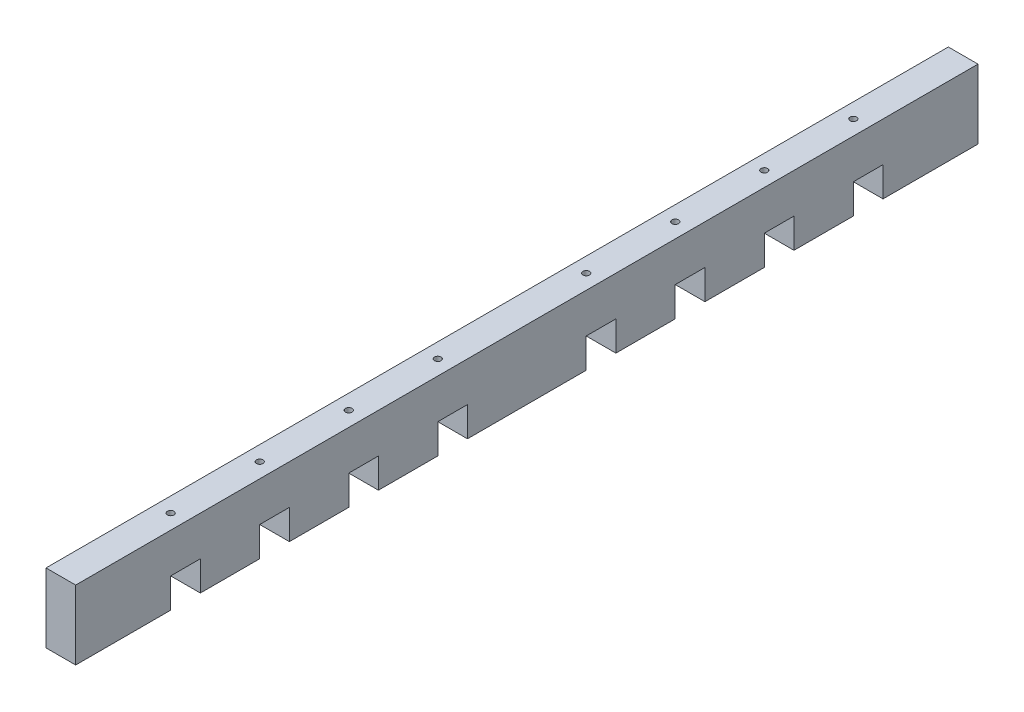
ISO-10303-21;
HEADER;
FILE_DESCRIPTION(('STEP AP214'),'2;1');
FILE_NAME('part.step','',(''),(''),'','','');
FILE_SCHEMA(('AUTOMOTIVE_DESIGN { 1 0 10303 214 1 1 1 1 }'));
ENDSEC;
DATA;
#1=APPLICATION_CONTEXT('core data for automotive mechanical design processes');
#2=APPLICATION_PROTOCOL_DEFINITION('international standard','automotive_design',2000,#1);
#3=PRODUCT_CONTEXT('',#1,'mechanical');
#4=PRODUCT('Part','Part','',(#3));
#5=PRODUCT_RELATED_PRODUCT_CATEGORY('part','',(#4));
#6=PRODUCT_DEFINITION_FORMATION('','',#4);
#7=PRODUCT_DEFINITION_CONTEXT('part definition',#1,'design');
#8=PRODUCT_DEFINITION('design','',#6,#7);
#9=PRODUCT_DEFINITION_SHAPE('','',#8);
#10=(LENGTH_UNIT() NAMED_UNIT(*) SI_UNIT(.MILLI.,.METRE.));
#11=(NAMED_UNIT(*) PLANE_ANGLE_UNIT() SI_UNIT($,.RADIAN.));
#12=(NAMED_UNIT(*) SI_UNIT($,.STERADIAN.) SOLID_ANGLE_UNIT());
#13=UNCERTAINTY_MEASURE_WITH_UNIT(LENGTH_MEASURE(1.E-05),#10,'distance_accuracy_value','');
#14=(GEOMETRIC_REPRESENTATION_CONTEXT(3) GLOBAL_UNCERTAINTY_ASSIGNED_CONTEXT((#13)) GLOBAL_UNIT_ASSIGNED_CONTEXT((#10,
#11,#12)) REPRESENTATION_CONTEXT('',''));
#15=CARTESIAN_POINT('',(0.,0.,0.));
#16=DIRECTION('',(0.,0.,1.));
#17=DIRECTION('',(1.,0.,0.));
#18=AXIS2_PLACEMENT_3D('',#15,#16,#17);
#19=CARTESIAN_POINT('',(0.,0.,228.));
#20=DIRECTION('',(0.,1.,0.));
#21=DIRECTION('',(-1.,0.,0.));
#22=AXIS2_PLACEMENT_3D('',#19,#20,#21);
#23=PLANE('',#22);
#24=DIRECTION('',(1.,0.,0.));
#25=VECTOR('',#24,1.);
#26=CARTESIAN_POINT('',(-15.,0.,-165.));
#27=LINE('',#26,#25);
#28=CARTESIAN_POINT('',(-15.,0.,-165.));
#29=VERTEX_POINT('',#28);
#30=CARTESIAN_POINT('',(0.,0.,-165.));
#31=VERTEX_POINT('',#30);
#32=EDGE_CURVE('E265',#29,#31,#27,.T.);
#33=ORIENTED_EDGE('',*,*,#32,.T.);
#34=DIRECTION('',(0.,0.,-1.));
#35=VECTOR('',#34,1.);
#36=CARTESIAN_POINT('',(0.,0.,228.));
#37=LINE('',#36,#35);
#38=CARTESIAN_POINT('',(0.,0.,-135.));
#39=VERTEX_POINT('',#38);
#40=EDGE_CURVE('E587',#39,#31,#37,.T.);
#41=ORIENTED_EDGE('',*,*,#40,.F.);
#42=DIRECTION('',(1.,0.,0.));
#43=VECTOR('',#42,1.);
#44=CARTESIAN_POINT('',(-15.,0.,-135.));
#45=LINE('',#44,#43);
#46=CARTESIAN_POINT('',(-15.,0.,-135.));
#47=VERTEX_POINT('',#46);
#48=EDGE_CURVE('E291',#47,#39,#45,.T.);
#49=ORIENTED_EDGE('',*,*,#48,.F.);
#50=DIRECTION('',(0.,0.,-1.));
#51=VECTOR('',#50,1.);
#52=CARTESIAN_POINT('',(-15.,0.,228.));
#53=LINE('',#52,#51);
#54=EDGE_CURVE('E285',#47,#29,#53,.T.);
#55=ORIENTED_EDGE('',*,*,#54,.T.);
#56=EDGE_LOOP('',(#33,#41,#49,#55));
#57=FACE_BOUND('',#56,.T.);
#58=ADVANCED_FACE('F33',(#57),#23,.F.);
#59=DIRECTION('',(1.,0.,0.));
#60=VECTOR('',#59,1.);
#61=CARTESIAN_POINT('',(-15.,0.,-180.));
#62=LINE('',#61,#60);
#63=CARTESIAN_POINT('',(-15.,0.,-180.));
#64=VERTEX_POINT('',#63);
#65=CARTESIAN_POINT('',(0.,0.,-180.));
#66=VERTEX_POINT('',#65);
#67=EDGE_CURVE('E277',#64,#66,#62,.T.);
#68=ORIENTED_EDGE('',*,*,#67,.F.);
#69=CARTESIAN_POINT('',(-15.,0.,-228.));
#70=VERTEX_POINT('',#69);
#71=EDGE_CURVE('E293',#64,#70,#53,.T.);
#72=ORIENTED_EDGE('',*,*,#71,.T.);
#73=DIRECTION('',(1.,0.,0.));
#74=VECTOR('',#73,1.);
#75=CARTESIAN_POINT('',(0.,0.,-228.));
#76=LINE('',#75,#74);
#77=CARTESIAN_POINT('',(0.,0.,-228.));
#78=VERTEX_POINT('',#77);
#79=EDGE_CURVE('E320',#70,#78,#76,.T.);
#80=ORIENTED_EDGE('',*,*,#79,.T.);
#81=EDGE_CURVE('E331',#66,#78,#37,.T.);
#82=ORIENTED_EDGE('',*,*,#81,.F.);
#83=EDGE_LOOP('',(#68,#72,#80,#82));
#84=FACE_BOUND('',#83,.T.);
#85=ADVANCED_FACE('F646',(#84),#23,.F.);
#86=CARTESIAN_POINT('',(0.,0.,228.));
#87=DIRECTION('',(-1.,0.,0.));
#88=DIRECTION('',(0.,0.,1.));
#89=AXIS2_PLACEMENT_3D('',#86,#87,#88);
#90=PLANE('',#89);
#91=DIRECTION('',(0.,1.,0.));
#92=VECTOR('',#91,1.);
#93=CARTESIAN_POINT('',(0.,0.,-165.));
#94=LINE('',#93,#92);
#95=CARTESIAN_POINT('',(0.,15.,-165.));
#96=VERTEX_POINT('',#95);
#97=EDGE_CURVE('E272',#31,#96,#94,.T.);
#98=ORIENTED_EDGE('',*,*,#97,.T.);
#99=DIRECTION('',(0.,0.,-1.));
#100=VECTOR('',#99,1.);
#101=CARTESIAN_POINT('',(0.,15.,-165.));
#102=LINE('',#101,#100);
#103=CARTESIAN_POINT('',(0.,15.,-180.));
#104=VERTEX_POINT('',#103);
#105=EDGE_CURVE('E288',#96,#104,#102,.T.);
#106=ORIENTED_EDGE('',*,*,#105,.T.);
#107=DIRECTION('',(0.,-1.,0.));
#108=VECTOR('',#107,1.);
#109=CARTESIAN_POINT('',(0.,0.,-180.));
#110=LINE('',#109,#108);
#111=EDGE_CURVE('E548',#104,#66,#110,.T.);
#112=ORIENTED_EDGE('',*,*,#111,.T.);
#113=ORIENTED_EDGE('',*,*,#81,.T.);
#114=DIRECTION('',(0.,1.,0.));
#115=VECTOR('',#114,1.);
#116=CARTESIAN_POINT('',(0.,0.,-228.));
#117=LINE('',#116,#115);
#118=CARTESIAN_POINT('',(0.,35.,-228.));
#119=VERTEX_POINT('',#118);
#120=EDGE_CURVE('E323',#78,#119,#117,.T.);
#121=ORIENTED_EDGE('',*,*,#120,.T.);
#122=DIRECTION('',(0.,0.,-1.));
#123=VECTOR('',#122,1.);
#124=CARTESIAN_POINT('',(0.,35.,228.));
#125=LINE('',#124,#123);
#126=CARTESIAN_POINT('',(0.,35.,228.));
#127=VERTEX_POINT('',#126);
#128=EDGE_CURVE('E11',#127,#119,#125,.T.);
#129=ORIENTED_EDGE('',*,*,#128,.F.);
#130=DIRECTION('',(0.,1.,0.));
#131=VECTOR('',#130,1.);
#132=CARTESIAN_POINT('',(0.,0.,228.));
#133=LINE('',#132,#131);
#134=CARTESIAN_POINT('',(0.,0.,228.));
#135=VERTEX_POINT('',#134);
#136=EDGE_CURVE('E322',#135,#127,#133,.T.);
#137=ORIENTED_EDGE('',*,*,#136,.F.);
#138=CARTESIAN_POINT('',(0.,0.,180.));
#139=VERTEX_POINT('',#138);
#140=EDGE_CURVE('E297',#135,#139,#37,.T.);
#141=ORIENTED_EDGE('',*,*,#140,.T.);
#142=DIRECTION('',(0.,-1.,0.));
#143=VECTOR('',#142,1.);
#144=CARTESIAN_POINT('',(0.,0.,180.));
#145=LINE('',#144,#143);
#146=CARTESIAN_POINT('',(0.,15.,180.));
#147=VERTEX_POINT('',#146);
#148=EDGE_CURVE('E433',#147,#139,#145,.T.);
#149=ORIENTED_EDGE('',*,*,#148,.F.);
#150=DIRECTION('',(0.,0.,1.));
#151=VECTOR('',#150,1.);
#152=CARTESIAN_POINT('',(0.,15.,165.));
#153=LINE('',#152,#151);
#154=CARTESIAN_POINT('',(0.,15.,165.));
#155=VERTEX_POINT('',#154);
#156=EDGE_CURVE('E436',#155,#147,#153,.T.);
#157=ORIENTED_EDGE('',*,*,#156,.F.);
#158=DIRECTION('',(0.,1.,0.));
#159=VECTOR('',#158,1.);
#160=CARTESIAN_POINT('',(0.,0.,165.));
#161=LINE('',#160,#159);
#162=CARTESIAN_POINT('',(0.,0.,165.));
#163=VERTEX_POINT('',#162);
#164=EDGE_CURVE('E439',#163,#155,#161,.T.);
#165=ORIENTED_EDGE('',*,*,#164,.F.);
#166=CARTESIAN_POINT('',(0.,0.,135.));
#167=VERTEX_POINT('',#166);
#168=EDGE_CURVE('E593',#163,#167,#37,.T.);
#169=ORIENTED_EDGE('',*,*,#168,.T.);
#170=DIRECTION('',(0.,-1.,0.));
#171=VECTOR('',#170,1.);
#172=CARTESIAN_POINT('',(0.,0.,135.));
#173=LINE('',#172,#171);
#174=CARTESIAN_POINT('',(0.,15.,135.));
#175=VERTEX_POINT('',#174);
#176=EDGE_CURVE('E406',#175,#167,#173,.T.);
#177=ORIENTED_EDGE('',*,*,#176,.F.);
#178=DIRECTION('',(0.,0.,1.));
#179=VECTOR('',#178,1.);
#180=CARTESIAN_POINT('',(0.,15.,120.));
#181=LINE('',#180,#179);
#182=CARTESIAN_POINT('',(0.,15.,120.));
#183=VERTEX_POINT('',#182);
#184=EDGE_CURVE('E410',#183,#175,#181,.T.);
#185=ORIENTED_EDGE('',*,*,#184,.F.);
#186=DIRECTION('',(0.,1.,0.));
#187=VECTOR('',#186,1.);
#188=CARTESIAN_POINT('',(0.,0.,120.));
#189=LINE('',#188,#187);
#190=CARTESIAN_POINT('',(0.,0.,120.));
#191=VERTEX_POINT('',#190);
#192=EDGE_CURVE('E413',#191,#183,#189,.T.);
#193=ORIENTED_EDGE('',*,*,#192,.F.);
#194=CARTESIAN_POINT('',(0.,0.,90.0000000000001));
#195=VERTEX_POINT('',#194);
#196=EDGE_CURVE('E598',#191,#195,#37,.T.);
#197=ORIENTED_EDGE('',*,*,#196,.T.);
#198=DIRECTION('',(0.,-1.,0.));
#199=VECTOR('',#198,1.);
#200=CARTESIAN_POINT('',(0.,0.,90.));
#201=LINE('',#200,#199);
#202=CARTESIAN_POINT('',(0.,15.,90.));
#203=VERTEX_POINT('',#202);
#204=EDGE_CURVE('E379',#203,#195,#201,.T.);
#205=ORIENTED_EDGE('',*,*,#204,.F.);
#206=DIRECTION('',(0.,0.,1.));
#207=VECTOR('',#206,1.);
#208=CARTESIAN_POINT('',(0.,15.,75.));
#209=LINE('',#208,#207);
#210=CARTESIAN_POINT('',(0.,15.,75.));
#211=VERTEX_POINT('',#210);
#212=EDGE_CURVE('E383',#211,#203,#209,.T.);
#213=ORIENTED_EDGE('',*,*,#212,.F.);
#214=DIRECTION('',(0.,1.,0.));
#215=VECTOR('',#214,1.);
#216=CARTESIAN_POINT('',(0.,0.,75.));
#217=LINE('',#216,#215);
#218=CARTESIAN_POINT('',(0.,0.,75.));
#219=VERTEX_POINT('',#218);
#220=EDGE_CURVE('E386',#219,#211,#217,.T.);
#221=ORIENTED_EDGE('',*,*,#220,.F.);
#222=CARTESIAN_POINT('',(0.,0.,45.));
#223=VERTEX_POINT('',#222);
#224=EDGE_CURVE('E600',#219,#223,#37,.T.);
#225=ORIENTED_EDGE('',*,*,#224,.T.);
#226=DIRECTION('',(0.,-1.,0.));
#227=VECTOR('',#226,1.);
#228=CARTESIAN_POINT('',(0.,0.,45.));
#229=LINE('',#228,#227);
#230=CARTESIAN_POINT('',(0.,15.,45.));
#231=VERTEX_POINT('',#230);
#232=EDGE_CURVE('E346',#231,#223,#229,.T.);
#233=ORIENTED_EDGE('',*,*,#232,.F.);
#234=DIRECTION('',(0.,0.,1.));
#235=VECTOR('',#234,1.);
#236=CARTESIAN_POINT('',(0.,15.,30.));
#237=LINE('',#236,#235);
#238=CARTESIAN_POINT('',(0.,15.,30.));
#239=VERTEX_POINT('',#238);
#240=EDGE_CURVE('E350',#239,#231,#237,.T.);
#241=ORIENTED_EDGE('',*,*,#240,.F.);
#242=DIRECTION('',(0.,1.,0.));
#243=VECTOR('',#242,1.);
#244=CARTESIAN_POINT('',(0.,0.,30.));
#245=LINE('',#244,#243);
#246=CARTESIAN_POINT('',(0.,0.,30.));
#247=VERTEX_POINT('',#246);
#248=EDGE_CURVE('E353',#247,#239,#245,.T.);
#249=ORIENTED_EDGE('',*,*,#248,.F.);
#250=CARTESIAN_POINT('',(0.,0.,-30.));
#251=VERTEX_POINT('',#250);
#252=EDGE_CURVE('E594',#247,#251,#37,.T.);
#253=ORIENTED_EDGE('',*,*,#252,.T.);
#254=DIRECTION('',(0.,1.,0.));
#255=VECTOR('',#254,1.);
#256=CARTESIAN_POINT('',(0.,0.,-30.));
#257=LINE('',#256,#255);
#258=CARTESIAN_POINT('',(0.,15.,-30.));
#259=VERTEX_POINT('',#258);
#260=EDGE_CURVE('E485',#251,#259,#257,.T.);
#261=ORIENTED_EDGE('',*,*,#260,.T.);
#262=DIRECTION('',(0.,0.,-1.));
#263=VECTOR('',#262,1.);
#264=CARTESIAN_POINT('',(0.,15.,-30.));
#265=LINE('',#264,#263);
#266=CARTESIAN_POINT('',(0.,15.,-45.));
#267=VERTEX_POINT('',#266);
#268=EDGE_CURVE('E478',#259,#267,#265,.T.);
#269=ORIENTED_EDGE('',*,*,#268,.T.);
#270=DIRECTION('',(0.,-1.,0.));
#271=VECTOR('',#270,1.);
#272=CARTESIAN_POINT('',(0.,0.,-45.));
#273=LINE('',#272,#271);
#274=CARTESIAN_POINT('',(0.,0.,-45.));
#275=VERTEX_POINT('',#274);
#276=EDGE_CURVE('E482',#267,#275,#273,.T.);
#277=ORIENTED_EDGE('',*,*,#276,.T.);
#278=CARTESIAN_POINT('',(0.,0.,-75.));
#279=VERTEX_POINT('',#278);
#280=EDGE_CURVE('E590',#275,#279,#37,.T.);
#281=ORIENTED_EDGE('',*,*,#280,.T.);
#282=DIRECTION('',(0.,1.,0.));
#283=VECTOR('',#282,1.);
#284=CARTESIAN_POINT('',(0.,0.,-75.));
#285=LINE('',#284,#283);
#286=CARTESIAN_POINT('',(0.,15.,-75.));
#287=VERTEX_POINT('',#286);
#288=EDGE_CURVE('E511',#279,#287,#285,.T.);
#289=ORIENTED_EDGE('',*,*,#288,.T.);
#290=DIRECTION('',(0.,0.,-1.));
#291=VECTOR('',#290,1.);
#292=CARTESIAN_POINT('',(0.,15.,-75.));
#293=LINE('',#292,#291);
#294=CARTESIAN_POINT('',(0.,15.,-90.));
#295=VERTEX_POINT('',#294);
#296=EDGE_CURVE('E504',#287,#295,#293,.T.);
#297=ORIENTED_EDGE('',*,*,#296,.T.);
#298=DIRECTION('',(0.,-1.,0.));
#299=VECTOR('',#298,1.);
#300=CARTESIAN_POINT('',(0.,0.,-90.));
#301=LINE('',#300,#299);
#302=CARTESIAN_POINT('',(0.,0.,-90.));
#303=VERTEX_POINT('',#302);
#304=EDGE_CURVE('E508',#295,#303,#301,.T.);
#305=ORIENTED_EDGE('',*,*,#304,.T.);
#306=CARTESIAN_POINT('',(0.,0.,-120.));
#307=VERTEX_POINT('',#306);
#308=EDGE_CURVE('E588',#303,#307,#37,.T.);
#309=ORIENTED_EDGE('',*,*,#308,.T.);
#310=DIRECTION('',(0.,1.,0.));
#311=VECTOR('',#310,1.);
#312=CARTESIAN_POINT('',(0.,0.,-120.));
#313=LINE('',#312,#311);
#314=CARTESIAN_POINT('',(0.,15.,-120.));
#315=VERTEX_POINT('',#314);
#316=EDGE_CURVE('E535',#307,#315,#313,.T.);
#317=ORIENTED_EDGE('',*,*,#316,.T.);
#318=DIRECTION('',(0.,0.,-1.));
#319=VECTOR('',#318,1.);
#320=CARTESIAN_POINT('',(0.,15.,-120.));
#321=LINE('',#320,#319);
#322=CARTESIAN_POINT('',(0.,15.,-135.));
#323=VERTEX_POINT('',#322);
#324=EDGE_CURVE('E528',#315,#323,#321,.T.);
#325=ORIENTED_EDGE('',*,*,#324,.T.);
#326=DIRECTION('',(0.,-1.,0.));
#327=VECTOR('',#326,1.);
#328=CARTESIAN_POINT('',(0.,0.,-135.));
#329=LINE('',#328,#327);
#330=EDGE_CURVE('E532',#323,#39,#329,.T.);
#331=ORIENTED_EDGE('',*,*,#330,.T.);
#332=ORIENTED_EDGE('',*,*,#40,.T.);
#333=EDGE_LOOP('',(#98,#106,#112,#113,#121,#129,#137,#141,#149,#157,#165,#169,#177,#185,#193,
#197,#205,#213,#221,#225,#233,#241,#249,#253,#261,#269,#277,#281,#289,#297,#305,#309,#317,#325,
#331,#332));
#334=FACE_BOUND('',#333,.T.);
#335=ADVANCED_FACE('F35',(#334),#90,.F.);
#336=CARTESIAN_POINT('',(-15.,0.,228.));
#337=DIRECTION('',(1.,0.,0.));
#338=DIRECTION('',(0.,0.,-1.));
#339=AXIS2_PLACEMENT_3D('',#336,#337,#338);
#340=PLANE('',#339);
#341=DIRECTION('',(0.,1.,0.));
#342=VECTOR('',#341,1.);
#343=CARTESIAN_POINT('',(-15.,0.,-165.));
#344=LINE('',#343,#342);
#345=CARTESIAN_POINT('',(-15.,15.,-165.));
#346=VERTEX_POINT('',#345);
#347=EDGE_CURVE('E269',#29,#346,#344,.T.);
#348=ORIENTED_EDGE('',*,*,#347,.F.);
#349=ORIENTED_EDGE('',*,*,#54,.F.);
#350=DIRECTION('',(0.,-1.,0.));
#351=VECTOR('',#350,1.);
#352=CARTESIAN_POINT('',(-15.,0.,-135.));
#353=LINE('',#352,#351);
#354=CARTESIAN_POINT('',(-15.,15.,-135.));
#355=VERTEX_POINT('',#354);
#356=EDGE_CURVE('E540',#355,#47,#353,.T.);
#357=ORIENTED_EDGE('',*,*,#356,.F.);
#358=DIRECTION('',(0.,0.,-1.));
#359=VECTOR('',#358,1.);
#360=CARTESIAN_POINT('',(-15.,15.,-120.));
#361=LINE('',#360,#359);
#362=CARTESIAN_POINT('',(-15.,15.,-120.));
#363=VERTEX_POINT('',#362);
#364=EDGE_CURVE('E523',#363,#355,#361,.T.);
#365=ORIENTED_EDGE('',*,*,#364,.F.);
#366=DIRECTION('',(0.,1.,0.));
#367=VECTOR('',#366,1.);
#368=CARTESIAN_POINT('',(-15.,0.,-120.));
#369=LINE('',#368,#367);
#370=CARTESIAN_POINT('',(-15.,0.,-120.));
#371=VERTEX_POINT('',#370);
#372=EDGE_CURVE('E531',#371,#363,#369,.T.);
#373=ORIENTED_EDGE('',*,*,#372,.F.);
#374=CARTESIAN_POINT('',(-15.,0.,-90.));
#375=VERTEX_POINT('',#374);
#376=EDGE_CURVE('E292',#375,#371,#53,.T.);
#377=ORIENTED_EDGE('',*,*,#376,.F.);
#378=DIRECTION('',(0.,-1.,0.));
#379=VECTOR('',#378,1.);
#380=CARTESIAN_POINT('',(-15.,0.,-90.));
#381=LINE('',#380,#379);
#382=CARTESIAN_POINT('',(-15.,15.,-90.));
#383=VERTEX_POINT('',#382);
#384=EDGE_CURVE('E517',#383,#375,#381,.T.);
#385=ORIENTED_EDGE('',*,*,#384,.F.);
#386=DIRECTION('',(0.,0.,-1.));
#387=VECTOR('',#386,1.);
#388=CARTESIAN_POINT('',(-15.,15.,-75.));
#389=LINE('',#388,#387);
#390=CARTESIAN_POINT('',(-15.,15.,-75.));
#391=VERTEX_POINT('',#390);
#392=EDGE_CURVE('E498',#391,#383,#389,.T.);
#393=ORIENTED_EDGE('',*,*,#392,.F.);
#394=DIRECTION('',(0.,1.,0.));
#395=VECTOR('',#394,1.);
#396=CARTESIAN_POINT('',(-15.,0.,-75.));
#397=LINE('',#396,#395);
#398=CARTESIAN_POINT('',(-15.,0.,-75.));
#399=VERTEX_POINT('',#398);
#400=EDGE_CURVE('E507',#399,#391,#397,.T.);
#401=ORIENTED_EDGE('',*,*,#400,.F.);
#402=CARTESIAN_POINT('',(-15.,0.,-45.));
#403=VERTEX_POINT('',#402);
#404=EDGE_CURVE('E296',#403,#399,#53,.T.);
#405=ORIENTED_EDGE('',*,*,#404,.F.);
#406=DIRECTION('',(0.,-1.,0.));
#407=VECTOR('',#406,1.);
#408=CARTESIAN_POINT('',(-15.,0.,-45.));
#409=LINE('',#408,#407);
#410=CARTESIAN_POINT('',(-15.,15.,-45.));
#411=VERTEX_POINT('',#410);
#412=EDGE_CURVE('E491',#411,#403,#409,.T.);
#413=ORIENTED_EDGE('',*,*,#412,.F.);
#414=DIRECTION('',(0.,0.,-1.));
#415=VECTOR('',#414,1.);
#416=CARTESIAN_POINT('',(-15.,15.,-30.));
#417=LINE('',#416,#415);
#418=CARTESIAN_POINT('',(-15.,15.,-30.));
#419=VERTEX_POINT('',#418);
#420=EDGE_CURVE('E472',#419,#411,#417,.T.);
#421=ORIENTED_EDGE('',*,*,#420,.F.);
#422=DIRECTION('',(0.,1.,0.));
#423=VECTOR('',#422,1.);
#424=CARTESIAN_POINT('',(-15.,0.,-30.));
#425=LINE('',#424,#423);
#426=CARTESIAN_POINT('',(-15.,0.,-30.));
#427=VERTEX_POINT('',#426);
#428=EDGE_CURVE('E481',#427,#419,#425,.T.);
#429=ORIENTED_EDGE('',*,*,#428,.F.);
#430=CARTESIAN_POINT('',(-15.,0.,30.));
#431=VERTEX_POINT('',#430);
#432=EDGE_CURVE('E302',#431,#427,#53,.T.);
#433=ORIENTED_EDGE('',*,*,#432,.F.);
#434=DIRECTION('',(0.,1.,0.));
#435=VECTOR('',#434,1.);
#436=CARTESIAN_POINT('',(-15.,0.,30.));
#437=LINE('',#436,#435);
#438=CARTESIAN_POINT('',(-15.,15.,30.));
#439=VERTEX_POINT('',#438);
#440=EDGE_CURVE('E349',#431,#439,#437,.T.);
#441=ORIENTED_EDGE('',*,*,#440,.T.);
#442=DIRECTION('',(0.,0.,1.));
#443=VECTOR('',#442,1.);
#444=CARTESIAN_POINT('',(-15.,15.,30.));
#445=LINE('',#444,#443);
#446=CARTESIAN_POINT('',(-15.,15.,45.));
#447=VERTEX_POINT('',#446);
#448=EDGE_CURVE('E359',#439,#447,#445,.T.);
#449=ORIENTED_EDGE('',*,*,#448,.T.);
#450=DIRECTION('',(0.,-1.,0.));
#451=VECTOR('',#450,1.);
#452=CARTESIAN_POINT('',(-15.,0.,45.));
#453=LINE('',#452,#451);
#454=CARTESIAN_POINT('',(-15.,0.,45.));
#455=VERTEX_POINT('',#454);
#456=EDGE_CURVE('E340',#447,#455,#453,.T.);
#457=ORIENTED_EDGE('',*,*,#456,.T.);
#458=CARTESIAN_POINT('',(-15.,0.,75.));
#459=VERTEX_POINT('',#458);
#460=EDGE_CURVE('E1004',#459,#455,#53,.T.);
#461=ORIENTED_EDGE('',*,*,#460,.F.);
#462=DIRECTION('',(0.,1.,0.));
#463=VECTOR('',#462,1.);
#464=CARTESIAN_POINT('',(-15.,0.,75.));
#465=LINE('',#464,#463);
#466=CARTESIAN_POINT('',(-15.,15.,75.));
#467=VERTEX_POINT('',#466);
#468=EDGE_CURVE('E382',#459,#467,#465,.T.);
#469=ORIENTED_EDGE('',*,*,#468,.T.);
#470=DIRECTION('',(0.,0.,1.));
#471=VECTOR('',#470,1.);
#472=CARTESIAN_POINT('',(-15.,15.,75.));
#473=LINE('',#472,#471);
#474=CARTESIAN_POINT('',(-15.,15.,90.));
#475=VERTEX_POINT('',#474);
#476=EDGE_CURVE('E392',#467,#475,#473,.T.);
#477=ORIENTED_EDGE('',*,*,#476,.T.);
#478=DIRECTION('',(0.,-1.,0.));
#479=VECTOR('',#478,1.);
#480=CARTESIAN_POINT('',(-15.,0.,90.));
#481=LINE('',#480,#479);
#482=CARTESIAN_POINT('',(-15.,0.,90.));
#483=VERTEX_POINT('',#482);
#484=EDGE_CURVE('E373',#475,#483,#481,.T.);
#485=ORIENTED_EDGE('',*,*,#484,.T.);
#486=CARTESIAN_POINT('',(-15.,0.,120.));
#487=VERTEX_POINT('',#486);
#488=EDGE_CURVE('E1000',#487,#483,#53,.T.);
#489=ORIENTED_EDGE('',*,*,#488,.F.);
#490=DIRECTION('',(0.,1.,0.));
#491=VECTOR('',#490,1.);
#492=CARTESIAN_POINT('',(-15.,0.,120.));
#493=LINE('',#492,#491);
#494=CARTESIAN_POINT('',(-15.,15.,120.));
#495=VERTEX_POINT('',#494);
#496=EDGE_CURVE('E409',#487,#495,#493,.T.);
#497=ORIENTED_EDGE('',*,*,#496,.T.);
#498=DIRECTION('',(0.,0.,1.));
#499=VECTOR('',#498,1.);
#500=CARTESIAN_POINT('',(-15.,15.,120.));
#501=LINE('',#500,#499);
#502=CARTESIAN_POINT('',(-15.,15.,135.));
#503=VERTEX_POINT('',#502);
#504=EDGE_CURVE('E419',#495,#503,#501,.T.);
#505=ORIENTED_EDGE('',*,*,#504,.T.);
#506=DIRECTION('',(0.,-1.,0.));
#507=VECTOR('',#506,1.);
#508=CARTESIAN_POINT('',(-15.,0.,135.));
#509=LINE('',#508,#507);
#510=CARTESIAN_POINT('',(-15.,0.,135.));
#511=VERTEX_POINT('',#510);
#512=EDGE_CURVE('E400',#503,#511,#509,.T.);
#513=ORIENTED_EDGE('',*,*,#512,.T.);
#514=CARTESIAN_POINT('',(-15.,0.,165.));
#515=VERTEX_POINT('',#514);
#516=EDGE_CURVE('E301',#515,#511,#53,.T.);
#517=ORIENTED_EDGE('',*,*,#516,.F.);
#518=DIRECTION('',(0.,1.,0.));
#519=VECTOR('',#518,1.);
#520=CARTESIAN_POINT('',(-15.,0.,165.));
#521=LINE('',#520,#519);
#522=CARTESIAN_POINT('',(-15.,15.,165.));
#523=VERTEX_POINT('',#522);
#524=EDGE_CURVE('E435',#515,#523,#521,.T.);
#525=ORIENTED_EDGE('',*,*,#524,.T.);
#526=DIRECTION('',(0.,0.,1.));
#527=VECTOR('',#526,1.);
#528=CARTESIAN_POINT('',(-15.,15.,165.));
#529=LINE('',#528,#527);
#530=CARTESIAN_POINT('',(-15.,15.,180.));
#531=VERTEX_POINT('',#530);
#532=EDGE_CURVE('E445',#523,#531,#529,.T.);
#533=ORIENTED_EDGE('',*,*,#532,.T.);
#534=DIRECTION('',(0.,-1.,0.));
#535=VECTOR('',#534,1.);
#536=CARTESIAN_POINT('',(-15.,0.,180.));
#537=LINE('',#536,#535);
#538=CARTESIAN_POINT('',(-15.,0.,180.));
#539=VERTEX_POINT('',#538);
#540=EDGE_CURVE('E427',#531,#539,#537,.T.);
#541=ORIENTED_EDGE('',*,*,#540,.T.);
#542=CARTESIAN_POINT('',(-15.,0.,228.));
#543=VERTEX_POINT('',#542);
#544=EDGE_CURVE('E298',#543,#539,#53,.T.);
#545=ORIENTED_EDGE('',*,*,#544,.F.);
#546=DIRECTION('',(0.,-1.,0.));
#547=VECTOR('',#546,1.);
#548=CARTESIAN_POINT('',(-15.,0.,228.));
#549=LINE('',#548,#547);
#550=CARTESIAN_POINT('',(-15.,35.,228.));
#551=VERTEX_POINT('',#550);
#552=EDGE_CURVE('E313',#551,#543,#549,.T.);
#553=ORIENTED_EDGE('',*,*,#552,.F.);
#554=DIRECTION('',(0.,0.,-1.));
#555=VECTOR('',#554,1.);
#556=CARTESIAN_POINT('',(-15.,35.,228.));
#557=LINE('',#556,#555);
#558=CARTESIAN_POINT('',(-15.,35.,-228.));
#559=VERTEX_POINT('',#558);
#560=EDGE_CURVE('E41',#551,#559,#557,.T.);
#561=ORIENTED_EDGE('',*,*,#560,.T.);
#562=DIRECTION('',(0.,-1.,0.));
#563=VECTOR('',#562,1.);
#564=CARTESIAN_POINT('',(-15.,0.,-228.));
#565=LINE('',#564,#563);
#566=EDGE_CURVE('E310',#559,#70,#565,.T.);
#567=ORIENTED_EDGE('',*,*,#566,.T.);
#568=ORIENTED_EDGE('',*,*,#71,.F.);
#569=DIRECTION('',(0.,-1.,0.));
#570=VECTOR('',#569,1.);
#571=CARTESIAN_POINT('',(-15.,0.,-180.));
#572=LINE('',#571,#570);
#573=CARTESIAN_POINT('',(-15.,15.,-180.));
#574=VERTEX_POINT('',#573);
#575=EDGE_CURVE('E287',#574,#64,#572,.T.);
#576=ORIENTED_EDGE('',*,*,#575,.F.);
#577=DIRECTION('',(0.,0.,-1.));
#578=VECTOR('',#577,1.);
#579=CARTESIAN_POINT('',(-15.,15.,-165.));
#580=LINE('',#579,#578);
#581=EDGE_CURVE('E278',#346,#574,#580,.T.);
#582=ORIENTED_EDGE('',*,*,#581,.F.);
#583=EDGE_LOOP('',(#348,#349,#357,#365,#373,#377,#385,#393,#401,#405,#413,#421,#429,#433,#441,
#449,#457,#461,#469,#477,#485,#489,#497,#505,#513,#517,#525,#533,#541,#545,#553,#561,#567,#568,
#576,#582));
#584=FACE_BOUND('',#583,.T.);
#585=ADVANCED_FACE('F283',(#584),#340,.F.);
#586=DIRECTION('',(1.,0.,0.));
#587=VECTOR('',#586,1.);
#588=CARTESIAN_POINT('',(-15.,0.,-120.));
#589=LINE('',#588,#587);
#590=EDGE_CURVE('E520',#371,#307,#589,.T.);
#591=ORIENTED_EDGE('',*,*,#590,.T.);
#592=ORIENTED_EDGE('',*,*,#308,.F.);
#593=DIRECTION('',(1.,0.,0.));
#594=VECTOR('',#593,1.);
#595=CARTESIAN_POINT('',(-15.,0.,-90.));
#596=LINE('',#595,#594);
#597=EDGE_CURVE('E497',#375,#303,#596,.T.);
#598=ORIENTED_EDGE('',*,*,#597,.F.);
#599=ORIENTED_EDGE('',*,*,#376,.T.);
#600=EDGE_LOOP('',(#591,#592,#598,#599));
#601=FACE_BOUND('',#600,.T.);
#602=ADVANCED_FACE('F626',(#601),#23,.F.);
#603=DIRECTION('',(1.,0.,0.));
#604=VECTOR('',#603,1.);
#605=CARTESIAN_POINT('',(-15.,0.,-75.));
#606=LINE('',#605,#604);
#607=EDGE_CURVE('E494',#399,#279,#606,.T.);
#608=ORIENTED_EDGE('',*,*,#607,.T.);
#609=ORIENTED_EDGE('',*,*,#280,.F.);
#610=DIRECTION('',(1.,0.,0.));
#611=VECTOR('',#610,1.);
#612=CARTESIAN_POINT('',(-15.,0.,-45.));
#613=LINE('',#612,#611);
#614=EDGE_CURVE('E471',#403,#275,#613,.T.);
#615=ORIENTED_EDGE('',*,*,#614,.F.);
#616=ORIENTED_EDGE('',*,*,#404,.T.);
#617=EDGE_LOOP('',(#608,#609,#615,#616));
#618=FACE_BOUND('',#617,.T.);
#619=ADVANCED_FACE('F608',(#618),#23,.F.);
#620=DIRECTION('',(1.,0.,0.));
#621=VECTOR('',#620,1.);
#622=CARTESIAN_POINT('',(-15.,0.,-30.));
#623=LINE('',#622,#621);
#624=EDGE_CURVE('E468',#427,#251,#623,.T.);
#625=ORIENTED_EDGE('',*,*,#624,.T.);
#626=ORIENTED_EDGE('',*,*,#252,.F.);
#627=DIRECTION('',(1.,0.,0.));
#628=VECTOR('',#627,1.);
#629=CARTESIAN_POINT('',(-15.,0.,30.));
#630=LINE('',#629,#628);
#631=EDGE_CURVE('E328',#431,#247,#630,.T.);
#632=ORIENTED_EDGE('',*,*,#631,.F.);
#633=ORIENTED_EDGE('',*,*,#432,.T.);
#634=EDGE_LOOP('',(#625,#626,#632,#633));
#635=FACE_BOUND('',#634,.T.);
#636=ADVANCED_FACE('F692',(#635),#23,.F.);
#637=ORIENTED_EDGE('',*,*,#168,.F.);
#638=DIRECTION('',(1.,0.,0.));
#639=VECTOR('',#638,1.);
#640=CARTESIAN_POINT('',(-15.,0.,165.));
#641=LINE('',#640,#639);
#642=EDGE_CURVE('E416',#515,#163,#641,.T.);
#643=ORIENTED_EDGE('',*,*,#642,.F.);
#644=ORIENTED_EDGE('',*,*,#516,.T.);
#645=DIRECTION('',(1.,0.,0.));
#646=VECTOR('',#645,1.);
#647=CARTESIAN_POINT('',(-15.,0.,135.));
#648=LINE('',#647,#646);
#649=EDGE_CURVE('E402',#511,#167,#648,.T.);
#650=ORIENTED_EDGE('',*,*,#649,.T.);
#651=EDGE_LOOP('',(#637,#643,#644,#650));
#652=FACE_BOUND('',#651,.T.);
#653=ADVANCED_FACE('F673',(#652),#23,.F.);
#654=ORIENTED_EDGE('',*,*,#196,.F.);
#655=DIRECTION('',(1.,0.,0.));
#656=VECTOR('',#655,1.);
#657=CARTESIAN_POINT('',(-15.,0.,120.));
#658=LINE('',#657,#656);
#659=EDGE_CURVE('E389',#487,#191,#658,.T.);
#660=ORIENTED_EDGE('',*,*,#659,.F.);
#661=ORIENTED_EDGE('',*,*,#488,.T.);
#662=DIRECTION('',(1.,0.,0.));
#663=VECTOR('',#662,1.);
#664=CARTESIAN_POINT('',(-15.,0.,90.));
#665=LINE('',#664,#663);
#666=EDGE_CURVE('E375',#483,#195,#665,.T.);
#667=ORIENTED_EDGE('',*,*,#666,.T.);
#668=EDGE_LOOP('',(#654,#660,#661,#667));
#669=FACE_BOUND('',#668,.T.);
#670=ADVANCED_FACE('F668',(#669),#23,.F.);
#671=ORIENTED_EDGE('',*,*,#224,.F.);
#672=DIRECTION('',(1.,0.,0.));
#673=VECTOR('',#672,1.);
#674=CARTESIAN_POINT('',(-15.,0.,75.));
#675=LINE('',#674,#673);
#676=EDGE_CURVE('E369',#459,#219,#675,.T.);
#677=ORIENTED_EDGE('',*,*,#676,.F.);
#678=ORIENTED_EDGE('',*,*,#460,.T.);
#679=DIRECTION('',(1.,0.,0.));
#680=VECTOR('',#679,1.);
#681=CARTESIAN_POINT('',(-15.,0.,45.));
#682=LINE('',#681,#680);
#683=EDGE_CURVE('E342',#455,#223,#682,.T.);
#684=ORIENTED_EDGE('',*,*,#683,.T.);
#685=EDGE_LOOP('',(#671,#677,#678,#684));
#686=FACE_BOUND('',#685,.T.);
#687=ADVANCED_FACE('F659',(#686),#23,.F.);
#688=CARTESIAN_POINT('',(0.,35.,228.));
#689=DIRECTION('',(0.,-1.,0.));
#690=DIRECTION('',(0.,0.,-1.));
#691=AXIS2_PLACEMENT_3D('',#688,#689,#690);
#692=PLANE('',#691);
#693=CARTESIAN_POINT('',(-7.5,35.,-172.5));
#694=DIRECTION('',(0.,-1.,0.));
#695=DIRECTION('',(0.,0.,-1.));
#696=AXIS2_PLACEMENT_3D('',#693,#694,#695);
#697=CIRCLE('',#696,1.65);
#698=CARTESIAN_POINT('',(-7.5,35.,-174.15));
#699=VERTEX_POINT('',#698);
#700=EDGE_CURVE('E572',#699,#699,#697,.T.);
#701=ORIENTED_EDGE('',*,*,#700,.T.);
#702=EDGE_LOOP('',(#701));
#703=FACE_BOUND('',#702,.T.);
#704=CARTESIAN_POINT('',(-7.5,35.,-127.5));
#705=DIRECTION('',(0.,-1.,0.));
#706=DIRECTION('',(0.,0.,-1.));
#707=AXIS2_PLACEMENT_3D('',#704,#705,#706);
#708=CIRCLE('',#707,1.65);
#709=CARTESIAN_POINT('',(-7.5,35.,-129.15));
#710=VERTEX_POINT('',#709);
#711=EDGE_CURVE('E566',#710,#710,#708,.T.);
#712=ORIENTED_EDGE('',*,*,#711,.T.);
#713=EDGE_LOOP('',(#712));
#714=FACE_BOUND('',#713,.T.);
#715=CARTESIAN_POINT('',(-7.5,35.,-82.5));
#716=DIRECTION('',(0.,-1.,0.));
#717=DIRECTION('',(0.,0.,-1.));
#718=AXIS2_PLACEMENT_3D('',#715,#716,#717);
#719=CIRCLE('',#718,1.65);
#720=CARTESIAN_POINT('',(-7.5,35.,-84.15));
#721=VERTEX_POINT('',#720);
#722=EDGE_CURVE('E560',#721,#721,#719,.T.);
#723=ORIENTED_EDGE('',*,*,#722,.T.);
#724=EDGE_LOOP('',(#723));
#725=FACE_BOUND('',#724,.T.);
#726=CARTESIAN_POINT('',(-7.5,35.,-37.5));
#727=DIRECTION('',(0.,-1.,0.));
#728=DIRECTION('',(0.,0.,-1.));
#729=AXIS2_PLACEMENT_3D('',#726,#727,#728);
#730=CIRCLE('',#729,1.65);
#731=CARTESIAN_POINT('',(-7.5,35.,-39.15));
#732=VERTEX_POINT('',#731);
#733=EDGE_CURVE('E552',#732,#732,#730,.T.);
#734=ORIENTED_EDGE('',*,*,#733,.T.);
#735=EDGE_LOOP('',(#734));
#736=FACE_BOUND('',#735,.T.);
#737=CARTESIAN_POINT('',(-7.5,35.,172.5));
#738=DIRECTION('',(0.,-1.,0.));
#739=DIRECTION('',(0.,0.,-1.));
#740=AXIS2_PLACEMENT_3D('',#737,#738,#739);
#741=CIRCLE('',#740,1.65);
#742=CARTESIAN_POINT('',(-7.5,35.,170.85));
#743=VERTEX_POINT('',#742);
#744=EDGE_CURVE('E461',#743,#743,#741,.T.);
#745=ORIENTED_EDGE('',*,*,#744,.T.);
#746=EDGE_LOOP('',(#745));
#747=FACE_BOUND('',#746,.T.);
#748=CARTESIAN_POINT('',(-7.5,35.,127.5));
#749=DIRECTION('',(0.,-1.,0.));
#750=DIRECTION('',(0.,0.,-1.));
#751=AXIS2_PLACEMENT_3D('',#748,#749,#750);
#752=CIRCLE('',#751,1.65);
#753=CARTESIAN_POINT('',(-7.5,35.,125.85));
#754=VERTEX_POINT('',#753);
#755=EDGE_CURVE('E455',#754,#754,#752,.T.);
#756=ORIENTED_EDGE('',*,*,#755,.T.);
#757=EDGE_LOOP('',(#756));
#758=FACE_BOUND('',#757,.T.);
#759=CARTESIAN_POINT('',(-7.5,35.,82.5));
#760=DIRECTION('',(0.,-1.,0.));
#761=DIRECTION('',(0.,0.,-1.));
#762=AXIS2_PLACEMENT_3D('',#759,#760,#761);
#763=CIRCLE('',#762,1.65);
#764=CARTESIAN_POINT('',(-7.5,35.,80.85));
#765=VERTEX_POINT('',#764);
#766=EDGE_CURVE('E442',#765,#765,#763,.T.);
#767=ORIENTED_EDGE('',*,*,#766,.T.);
#768=EDGE_LOOP('',(#767));
#769=FACE_BOUND('',#768,.T.);
#770=CARTESIAN_POINT('',(-7.5,35.,37.5));
#771=DIRECTION('',(0.,-1.,0.));
#772=DIRECTION('',(0.,0.,-1.));
#773=AXIS2_PLACEMENT_3D('',#770,#771,#772);
#774=CIRCLE('',#773,1.65);
#775=CARTESIAN_POINT('',(-7.5,35.,35.85));
#776=VERTEX_POINT('',#775);
#777=EDGE_CURVE('E356',#776,#776,#774,.T.);
#778=ORIENTED_EDGE('',*,*,#777,.T.);
#779=EDGE_LOOP('',(#778));
#780=FACE_BOUND('',#779,.T.);
#781=DIRECTION('',(-1.,0.,0.));
#782=VECTOR('',#781,1.);
#783=CARTESIAN_POINT('',(0.,35.,-228.));
#784=LINE('',#783,#782);
#785=EDGE_CURVE('E318',#119,#559,#784,.T.);
#786=ORIENTED_EDGE('',*,*,#785,.T.);
#787=ORIENTED_EDGE('',*,*,#560,.F.);
#788=DIRECTION('',(-1.,0.,0.));
#789=VECTOR('',#788,1.);
#790=CARTESIAN_POINT('',(0.,35.,228.));
#791=LINE('',#790,#789);
#792=EDGE_CURVE('E333',#127,#551,#791,.T.);
#793=ORIENTED_EDGE('',*,*,#792,.F.);
#794=ORIENTED_EDGE('',*,*,#128,.T.);
#795=EDGE_LOOP('',(#786,#787,#793,#794));
#796=FACE_BOUND('',#795,.T.);
#797=ADVANCED_FACE('F657',(#703,#714,#725,#736,#747,#758,#769,#780,#796),#692,.F.);
#798=ORIENTED_EDGE('',*,*,#544,.T.);
#799=DIRECTION('',(1.,0.,0.));
#800=VECTOR('',#799,1.);
#801=CARTESIAN_POINT('',(-15.,0.,180.));
#802=LINE('',#801,#800);
#803=EDGE_CURVE('E429',#539,#139,#802,.T.);
#804=ORIENTED_EDGE('',*,*,#803,.T.);
#805=ORIENTED_EDGE('',*,*,#140,.F.);
#806=DIRECTION('',(1.,0.,0.));
#807=VECTOR('',#806,1.);
#808=CARTESIAN_POINT('',(0.,0.,228.));
#809=LINE('',#808,#807);
#810=EDGE_CURVE('E329',#543,#135,#809,.T.);
#811=ORIENTED_EDGE('',*,*,#810,.F.);
#812=EDGE_LOOP('',(#798,#804,#805,#811));
#813=FACE_BOUND('',#812,.T.);
#814=ADVANCED_FACE('F648',(#813),#23,.F.);
#815=CARTESIAN_POINT('',(0.,35.,228.));
#816=DIRECTION('',(0.,0.,1.));
#817=DIRECTION('',(1.,0.,0.));
#818=AXIS2_PLACEMENT_3D('',#815,#816,#817);
#819=PLANE('',#818);
#820=ORIENTED_EDGE('',*,*,#136,.T.);
#821=ORIENTED_EDGE('',*,*,#792,.T.);
#822=ORIENTED_EDGE('',*,*,#552,.T.);
#823=ORIENTED_EDGE('',*,*,#810,.T.);
#824=EDGE_LOOP('',(#820,#821,#822,#823));
#825=FACE_BOUND('',#824,.T.);
#826=ADVANCED_FACE('F656',(#825),#819,.T.);
#827=CARTESIAN_POINT('',(0.,35.,-228.));
#828=DIRECTION('',(0.,0.,1.));
#829=DIRECTION('',(1.,0.,0.));
#830=AXIS2_PLACEMENT_3D('',#827,#828,#829);
#831=PLANE('',#830);
#832=ORIENTED_EDGE('',*,*,#120,.F.);
#833=ORIENTED_EDGE('',*,*,#79,.F.);
#834=ORIENTED_EDGE('',*,*,#566,.F.);
#835=ORIENTED_EDGE('',*,*,#785,.F.);
#836=EDGE_LOOP('',(#832,#833,#834,#835));
#837=FACE_BOUND('',#836,.T.);
#838=ADVANCED_FACE('F317',(#837),#831,.F.);
#839=CARTESIAN_POINT('',(-15.,0.,30.));
#840=DIRECTION('',(0.,0.,-1.));
#841=DIRECTION('',(-1.,0.,0.));
#842=AXIS2_PLACEMENT_3D('',#839,#840,#841);
#843=PLANE('',#842);
#844=ORIENTED_EDGE('',*,*,#248,.T.);
#845=DIRECTION('',(1.,0.,0.));
#846=VECTOR('',#845,1.);
#847=CARTESIAN_POINT('',(-15.,15.,30.));
#848=LINE('',#847,#846);
#849=EDGE_CURVE('E337',#439,#239,#848,.T.);
#850=ORIENTED_EDGE('',*,*,#849,.F.);
#851=ORIENTED_EDGE('',*,*,#440,.F.);
#852=ORIENTED_EDGE('',*,*,#631,.T.);
#853=EDGE_LOOP('',(#844,#850,#851,#852));
#854=FACE_BOUND('',#853,.T.);
#855=ADVANCED_FACE('F770',(#854),#843,.F.);
#856=CARTESIAN_POINT('',(-15.,0.,45.));
#857=DIRECTION('',(0.,0.,1.));
#858=DIRECTION('',(1.,0.,0.));
#859=AXIS2_PLACEMENT_3D('',#856,#857,#858);
#860=PLANE('',#859);
#861=ORIENTED_EDGE('',*,*,#232,.T.);
#862=ORIENTED_EDGE('',*,*,#683,.F.);
#863=ORIENTED_EDGE('',*,*,#456,.F.);
#864=DIRECTION('',(1.,0.,0.));
#865=VECTOR('',#864,1.);
#866=CARTESIAN_POINT('',(-15.,15.,45.));
#867=LINE('',#866,#865);
#868=EDGE_CURVE('E339',#447,#231,#867,.T.);
#869=ORIENTED_EDGE('',*,*,#868,.T.);
#870=EDGE_LOOP('',(#861,#862,#863,#869));
#871=FACE_BOUND('',#870,.T.);
#872=ADVANCED_FACE('F684',(#871),#860,.F.);
#873=CARTESIAN_POINT('',(-15.,15.,30.));
#874=DIRECTION('',(0.,1.,0.));
#875=DIRECTION('',(0.,0.,1.));
#876=AXIS2_PLACEMENT_3D('',#873,#874,#875);
#877=PLANE('',#876);
#878=CARTESIAN_POINT('',(-7.5,15.,37.5));
#879=DIRECTION('',(0.,-1.,0.));
#880=DIRECTION('',(0.,0.,-1.));
#881=AXIS2_PLACEMENT_3D('',#878,#879,#880);
#882=CIRCLE('',#881,1.65);
#883=CARTESIAN_POINT('',(-7.5,15.,35.85));
#884=VERTEX_POINT('',#883);
#885=EDGE_CURVE('E366',#884,#884,#882,.T.);
#886=ORIENTED_EDGE('',*,*,#885,.F.);
#887=EDGE_LOOP('',(#886));
#888=FACE_BOUND('',#887,.T.);
#889=ORIENTED_EDGE('',*,*,#240,.T.);
#890=ORIENTED_EDGE('',*,*,#868,.F.);
#891=ORIENTED_EDGE('',*,*,#448,.F.);
#892=ORIENTED_EDGE('',*,*,#849,.T.);
#893=EDGE_LOOP('',(#889,#890,#891,#892));
#894=FACE_BOUND('',#893,.T.);
#895=ADVANCED_FACE('F688',(#888,#894),#877,.F.);
#896=CARTESIAN_POINT('',(-7.5,15.,37.5));
#897=DIRECTION('',(0.,-1.,0.));
#898=DIRECTION('',(0.,0.,-1.));
#899=AXIS2_PLACEMENT_3D('',#896,#897,#898);
#900=CYLINDRICAL_SURFACE('',#899,1.65);
#901=ORIENTED_EDGE('',*,*,#777,.F.);
#902=EDGE_LOOP('',(#901));
#903=FACE_BOUND('',#902,.T.);
#904=ORIENTED_EDGE('',*,*,#885,.T.);
#905=EDGE_LOOP('',(#904));
#906=FACE_BOUND('',#905,.T.);
#907=ADVANCED_FACE('F763',(#903,#906),#900,.F.);
#908=CARTESIAN_POINT('',(-15.,0.,75.));
#909=DIRECTION('',(0.,0.,-1.));
#910=DIRECTION('',(-1.,0.,0.));
#911=AXIS2_PLACEMENT_3D('',#908,#909,#910);
#912=PLANE('',#911);
#913=ORIENTED_EDGE('',*,*,#220,.T.);
#914=DIRECTION('',(1.,0.,0.));
#915=VECTOR('',#914,1.);
#916=CARTESIAN_POINT('',(-15.,15.,75.));
#917=LINE('',#916,#915);
#918=EDGE_CURVE('E370',#467,#211,#917,.T.);
#919=ORIENTED_EDGE('',*,*,#918,.F.);
#920=ORIENTED_EDGE('',*,*,#468,.F.);
#921=ORIENTED_EDGE('',*,*,#676,.T.);
#922=EDGE_LOOP('',(#913,#919,#920,#921));
#923=FACE_BOUND('',#922,.T.);
#924=ADVANCED_FACE('F756',(#923),#912,.F.);
#925=CARTESIAN_POINT('',(-15.,0.,90.));
#926=DIRECTION('',(0.,0.,1.));
#927=DIRECTION('',(1.,0.,0.));
#928=AXIS2_PLACEMENT_3D('',#925,#926,#927);
#929=PLANE('',#928);
#930=ORIENTED_EDGE('',*,*,#204,.T.);
#931=ORIENTED_EDGE('',*,*,#666,.F.);
#932=ORIENTED_EDGE('',*,*,#484,.F.);
#933=DIRECTION('',(1.,0.,0.));
#934=VECTOR('',#933,1.);
#935=CARTESIAN_POINT('',(-15.,15.,90.));
#936=LINE('',#935,#934);
#937=EDGE_CURVE('E372',#475,#203,#936,.T.);
#938=ORIENTED_EDGE('',*,*,#937,.T.);
#939=EDGE_LOOP('',(#930,#931,#932,#938));
#940=FACE_BOUND('',#939,.T.);
#941=ADVANCED_FACE('F753',(#940),#929,.F.);
#942=CARTESIAN_POINT('',(-15.,15.,75.));
#943=DIRECTION('',(0.,1.,0.));
#944=DIRECTION('',(0.,0.,1.));
#945=AXIS2_PLACEMENT_3D('',#942,#943,#944);
#946=PLANE('',#945);
#947=CARTESIAN_POINT('',(-7.5,15.,82.5));
#948=DIRECTION('',(0.,-1.,0.));
#949=DIRECTION('',(0.,0.,-1.));
#950=AXIS2_PLACEMENT_3D('',#947,#948,#949);
#951=CIRCLE('',#950,1.65);
#952=CARTESIAN_POINT('',(-7.5,15.,80.85));
#953=VERTEX_POINT('',#952);
#954=EDGE_CURVE('E452',#953,#953,#951,.T.);
#955=ORIENTED_EDGE('',*,*,#954,.F.);
#956=EDGE_LOOP('',(#955));
#957=FACE_BOUND('',#956,.T.);
#958=ORIENTED_EDGE('',*,*,#212,.T.);
#959=ORIENTED_EDGE('',*,*,#937,.F.);
#960=ORIENTED_EDGE('',*,*,#476,.F.);
#961=ORIENTED_EDGE('',*,*,#918,.T.);
#962=EDGE_LOOP('',(#958,#959,#960,#961));
#963=FACE_BOUND('',#962,.T.);
#964=ADVANCED_FACE('F751',(#957,#963),#946,.F.);
#965=CARTESIAN_POINT('',(-15.,0.,120.));
#966=DIRECTION('',(0.,0.,-1.));
#967=DIRECTION('',(-1.,0.,0.));
#968=AXIS2_PLACEMENT_3D('',#965,#966,#967);
#969=PLANE('',#968);
#970=ORIENTED_EDGE('',*,*,#192,.T.);
#971=DIRECTION('',(1.,0.,0.));
#972=VECTOR('',#971,1.);
#973=CARTESIAN_POINT('',(-15.,15.,120.));
#974=LINE('',#973,#972);
#975=EDGE_CURVE('E397',#495,#183,#974,.T.);
#976=ORIENTED_EDGE('',*,*,#975,.F.);
#977=ORIENTED_EDGE('',*,*,#496,.F.);
#978=ORIENTED_EDGE('',*,*,#659,.T.);
#979=EDGE_LOOP('',(#970,#976,#977,#978));
#980=FACE_BOUND('',#979,.T.);
#981=ADVANCED_FACE('F744',(#980),#969,.F.);
#982=CARTESIAN_POINT('',(-15.,0.,135.));
#983=DIRECTION('',(0.,0.,1.));
#984=DIRECTION('',(1.,0.,0.));
#985=AXIS2_PLACEMENT_3D('',#982,#983,#984);
#986=PLANE('',#985);
#987=ORIENTED_EDGE('',*,*,#176,.T.);
#988=ORIENTED_EDGE('',*,*,#649,.F.);
#989=ORIENTED_EDGE('',*,*,#512,.F.);
#990=DIRECTION('',(1.,0.,0.));
#991=VECTOR('',#990,1.);
#992=CARTESIAN_POINT('',(-15.,15.,135.));
#993=LINE('',#992,#991);
#994=EDGE_CURVE('E399',#503,#175,#993,.T.);
#995=ORIENTED_EDGE('',*,*,#994,.T.);
#996=EDGE_LOOP('',(#987,#988,#989,#995));
#997=FACE_BOUND('',#996,.T.);
#998=ADVANCED_FACE('F741',(#997),#986,.F.);
#999=CARTESIAN_POINT('',(-15.,15.,120.));
#1000=DIRECTION('',(0.,1.,0.));
#1001=DIRECTION('',(0.,0.,1.));
#1002=AXIS2_PLACEMENT_3D('',#999,#1000,#1001);
#1003=PLANE('',#1002);
#1004=CARTESIAN_POINT('',(-7.5,15.,127.5));
#1005=DIRECTION('',(0.,-1.,0.));
#1006=DIRECTION('',(0.,0.,-1.));
#1007=AXIS2_PLACEMENT_3D('',#1004,#1005,#1006);
#1008=CIRCLE('',#1007,1.65);
#1009=CARTESIAN_POINT('',(-7.5,15.,125.85));
#1010=VERTEX_POINT('',#1009);
#1011=EDGE_CURVE('E458',#1010,#1010,#1008,.T.);
#1012=ORIENTED_EDGE('',*,*,#1011,.F.);
#1013=EDGE_LOOP('',(#1012));
#1014=FACE_BOUND('',#1013,.T.);
#1015=ORIENTED_EDGE('',*,*,#184,.T.);
#1016=ORIENTED_EDGE('',*,*,#994,.F.);
#1017=ORIENTED_EDGE('',*,*,#504,.F.);
#1018=ORIENTED_EDGE('',*,*,#975,.T.);
#1019=EDGE_LOOP('',(#1015,#1016,#1017,#1018));
#1020=FACE_BOUND('',#1019,.T.);
#1021=ADVANCED_FACE('F739',(#1014,#1020),#1003,.F.);
#1022=CARTESIAN_POINT('',(-15.,0.,165.));
#1023=DIRECTION('',(0.,0.,-1.));
#1024=DIRECTION('',(-1.,0.,0.));
#1025=AXIS2_PLACEMENT_3D('',#1022,#1023,#1024);
#1026=PLANE('',#1025);
#1027=ORIENTED_EDGE('',*,*,#164,.T.);
#1028=DIRECTION('',(1.,0.,0.));
#1029=VECTOR('',#1028,1.);
#1030=CARTESIAN_POINT('',(-15.,15.,165.));
#1031=LINE('',#1030,#1029);
#1032=EDGE_CURVE('E424',#523,#155,#1031,.T.);
#1033=ORIENTED_EDGE('',*,*,#1032,.F.);
#1034=ORIENTED_EDGE('',*,*,#524,.F.);
#1035=ORIENTED_EDGE('',*,*,#642,.T.);
#1036=EDGE_LOOP('',(#1027,#1033,#1034,#1035));
#1037=FACE_BOUND('',#1036,.T.);
#1038=ADVANCED_FACE('F732',(#1037),#1026,.F.);
#1039=CARTESIAN_POINT('',(-15.,0.,180.));
#1040=DIRECTION('',(0.,0.,1.));
#1041=DIRECTION('',(1.,0.,0.));
#1042=AXIS2_PLACEMENT_3D('',#1039,#1040,#1041);
#1043=PLANE('',#1042);
#1044=ORIENTED_EDGE('',*,*,#148,.T.);
#1045=ORIENTED_EDGE('',*,*,#803,.F.);
#1046=ORIENTED_EDGE('',*,*,#540,.F.);
#1047=DIRECTION('',(1.,0.,0.));
#1048=VECTOR('',#1047,1.);
#1049=CARTESIAN_POINT('',(-15.,15.,180.));
#1050=LINE('',#1049,#1048);
#1051=EDGE_CURVE('E426',#531,#147,#1050,.T.);
#1052=ORIENTED_EDGE('',*,*,#1051,.T.);
#1053=EDGE_LOOP('',(#1044,#1045,#1046,#1052));
#1054=FACE_BOUND('',#1053,.T.);
#1055=ADVANCED_FACE('F729',(#1054),#1043,.F.);
#1056=CARTESIAN_POINT('',(-15.,15.,165.));
#1057=DIRECTION('',(0.,1.,0.));
#1058=DIRECTION('',(0.,0.,1.));
#1059=AXIS2_PLACEMENT_3D('',#1056,#1057,#1058);
#1060=PLANE('',#1059);
#1061=CARTESIAN_POINT('',(-7.5,15.,172.5));
#1062=DIRECTION('',(0.,-1.,0.));
#1063=DIRECTION('',(0.,0.,-1.));
#1064=AXIS2_PLACEMENT_3D('',#1061,#1062,#1063);
#1065=CIRCLE('',#1064,1.65);
#1066=CARTESIAN_POINT('',(-7.5,15.,170.85));
#1067=VERTEX_POINT('',#1066);
#1068=EDGE_CURVE('E464',#1067,#1067,#1065,.T.);
#1069=ORIENTED_EDGE('',*,*,#1068,.F.);
#1070=EDGE_LOOP('',(#1069));
#1071=FACE_BOUND('',#1070,.T.);
#1072=ORIENTED_EDGE('',*,*,#156,.T.);
#1073=ORIENTED_EDGE('',*,*,#1051,.F.);
#1074=ORIENTED_EDGE('',*,*,#532,.F.);
#1075=ORIENTED_EDGE('',*,*,#1032,.T.);
#1076=EDGE_LOOP('',(#1072,#1073,#1074,#1075));
#1077=FACE_BOUND('',#1076,.T.);
#1078=ADVANCED_FACE('F727',(#1071,#1077),#1060,.F.);
#1079=CARTESIAN_POINT('',(-7.5,15.,82.5));
#1080=DIRECTION('',(0.,-1.,0.));
#1081=DIRECTION('',(0.,0.,-1.));
#1082=AXIS2_PLACEMENT_3D('',#1079,#1080,#1081);
#1083=CYLINDRICAL_SURFACE('',#1082,1.65);
#1084=ORIENTED_EDGE('',*,*,#766,.F.);
#1085=EDGE_LOOP('',(#1084));
#1086=FACE_BOUND('',#1085,.T.);
#1087=ORIENTED_EDGE('',*,*,#954,.T.);
#1088=EDGE_LOOP('',(#1087));
#1089=FACE_BOUND('',#1088,.T.);
#1090=ADVANCED_FACE('F723',(#1086,#1089),#1083,.F.);
#1091=CARTESIAN_POINT('',(-7.5,15.,127.5));
#1092=DIRECTION('',(0.,-1.,0.));
#1093=DIRECTION('',(0.,0.,-1.));
#1094=AXIS2_PLACEMENT_3D('',#1091,#1092,#1093);
#1095=CYLINDRICAL_SURFACE('',#1094,1.65);
#1096=ORIENTED_EDGE('',*,*,#755,.F.);
#1097=EDGE_LOOP('',(#1096));
#1098=FACE_BOUND('',#1097,.T.);
#1099=ORIENTED_EDGE('',*,*,#1011,.T.);
#1100=EDGE_LOOP('',(#1099));
#1101=FACE_BOUND('',#1100,.T.);
#1102=ADVANCED_FACE('F719',(#1098,#1101),#1095,.F.);
#1103=CARTESIAN_POINT('',(-7.5,15.,172.5));
#1104=DIRECTION('',(0.,-1.,0.));
#1105=DIRECTION('',(0.,0.,-1.));
#1106=AXIS2_PLACEMENT_3D('',#1103,#1104,#1105);
#1107=CYLINDRICAL_SURFACE('',#1106,1.65);
#1108=ORIENTED_EDGE('',*,*,#744,.F.);
#1109=EDGE_LOOP('',(#1108));
#1110=FACE_BOUND('',#1109,.T.);
#1111=ORIENTED_EDGE('',*,*,#1068,.T.);
#1112=EDGE_LOOP('',(#1111));
#1113=FACE_BOUND('',#1112,.T.);
#1114=ADVANCED_FACE('F716',(#1110,#1113),#1107,.F.);
#1115=CARTESIAN_POINT('',(-15.,0.,-30.));
#1116=DIRECTION('',(0.,0.,-1.));
#1117=DIRECTION('',(-1.,0.,0.));
#1118=AXIS2_PLACEMENT_3D('',#1115,#1116,#1117);
#1119=PLANE('',#1118);
#1120=ORIENTED_EDGE('',*,*,#260,.F.);
#1121=ORIENTED_EDGE('',*,*,#624,.F.);
#1122=ORIENTED_EDGE('',*,*,#428,.T.);
#1123=DIRECTION('',(1.,0.,0.));
#1124=VECTOR('',#1123,1.);
#1125=CARTESIAN_POINT('',(-15.,15.,-30.));
#1126=LINE('',#1125,#1124);
#1127=EDGE_CURVE('E467',#419,#259,#1126,.T.);
#1128=ORIENTED_EDGE('',*,*,#1127,.T.);
#1129=EDGE_LOOP('',(#1120,#1121,#1122,#1128));
#1130=FACE_BOUND('',#1129,.T.);
#1131=ADVANCED_FACE('F697',(#1130),#1119,.T.);
#1132=CARTESIAN_POINT('',(-15.,15.,-30.));
#1133=DIRECTION('',(0.,-1.,0.));
#1134=DIRECTION('',(0.,0.,-1.));
#1135=AXIS2_PLACEMENT_3D('',#1132,#1133,#1134);
#1136=PLANE('',#1135);
#1137=CARTESIAN_POINT('',(-7.5,15.,-37.5));
#1138=DIRECTION('',(0.,-1.,0.));
#1139=DIRECTION('',(0.,0.,-1.));
#1140=AXIS2_PLACEMENT_3D('',#1137,#1138,#1139);
#1141=CIRCLE('',#1140,1.65);
#1142=CARTESIAN_POINT('',(-7.5,15.,-39.15));
#1143=VERTEX_POINT('',#1142);
#1144=EDGE_CURVE('E557',#1143,#1143,#1141,.T.);
#1145=ORIENTED_EDGE('',*,*,#1144,.F.);
#1146=EDGE_LOOP('',(#1145));
#1147=FACE_BOUND('',#1146,.T.);
#1148=ORIENTED_EDGE('',*,*,#268,.F.);
#1149=ORIENTED_EDGE('',*,*,#1127,.F.);
#1150=ORIENTED_EDGE('',*,*,#420,.T.);
#1151=DIRECTION('',(1.,0.,0.));
#1152=VECTOR('',#1151,1.);
#1153=CARTESIAN_POINT('',(-15.,15.,-45.));
#1154=LINE('',#1153,#1152);
#1155=EDGE_CURVE('E474',#411,#267,#1154,.T.);
#1156=ORIENTED_EDGE('',*,*,#1155,.T.);
#1157=EDGE_LOOP('',(#1148,#1149,#1150,#1156));
#1158=FACE_BOUND('',#1157,.T.);
#1159=ADVANCED_FACE('F701',(#1147,#1158),#1136,.T.);
#1160=CARTESIAN_POINT('',(-15.,0.,-45.));
#1161=DIRECTION('',(0.,0.,1.));
#1162=DIRECTION('',(1.,0.,0.));
#1163=AXIS2_PLACEMENT_3D('',#1160,#1161,#1162);
#1164=PLANE('',#1163);
#1165=ORIENTED_EDGE('',*,*,#276,.F.);
#1166=ORIENTED_EDGE('',*,*,#1155,.F.);
#1167=ORIENTED_EDGE('',*,*,#412,.T.);
#1168=ORIENTED_EDGE('',*,*,#614,.T.);
#1169=EDGE_LOOP('',(#1165,#1166,#1167,#1168));
#1170=FACE_BOUND('',#1169,.T.);
#1171=ADVANCED_FACE('F703',(#1170),#1164,.T.);
#1172=CARTESIAN_POINT('',(-15.,0.,-75.));
#1173=DIRECTION('',(0.,0.,-1.));
#1174=DIRECTION('',(-1.,0.,0.));
#1175=AXIS2_PLACEMENT_3D('',#1172,#1173,#1174);
#1176=PLANE('',#1175);
#1177=ORIENTED_EDGE('',*,*,#288,.F.);
#1178=ORIENTED_EDGE('',*,*,#607,.F.);
#1179=ORIENTED_EDGE('',*,*,#400,.T.);
#1180=DIRECTION('',(1.,0.,0.));
#1181=VECTOR('',#1180,1.);
#1182=CARTESIAN_POINT('',(-15.,15.,-75.));
#1183=LINE('',#1182,#1181);
#1184=EDGE_CURVE('E488',#391,#287,#1183,.T.);
#1185=ORIENTED_EDGE('',*,*,#1184,.T.);
#1186=EDGE_LOOP('',(#1177,#1178,#1179,#1185));
#1187=FACE_BOUND('',#1186,.T.);
#1188=ADVANCED_FACE('F613',(#1187),#1176,.T.);
#1189=CARTESIAN_POINT('',(-15.,15.,-75.));
#1190=DIRECTION('',(0.,-1.,0.));
#1191=DIRECTION('',(0.,0.,-1.));
#1192=AXIS2_PLACEMENT_3D('',#1189,#1190,#1191);
#1193=PLANE('',#1192);
#1194=CARTESIAN_POINT('',(-7.5,15.,-82.5));
#1195=DIRECTION('',(0.,-1.,0.));
#1196=DIRECTION('',(0.,0.,-1.));
#1197=AXIS2_PLACEMENT_3D('',#1194,#1195,#1196);
#1198=CIRCLE('',#1197,1.65);
#1199=CARTESIAN_POINT('',(-7.5,15.,-84.15));
#1200=VERTEX_POINT('',#1199);
#1201=EDGE_CURVE('E563',#1200,#1200,#1198,.T.);
#1202=ORIENTED_EDGE('',*,*,#1201,.F.);
#1203=EDGE_LOOP('',(#1202));
#1204=FACE_BOUND('',#1203,.T.);
#1205=ORIENTED_EDGE('',*,*,#296,.F.);
#1206=ORIENTED_EDGE('',*,*,#1184,.F.);
#1207=ORIENTED_EDGE('',*,*,#392,.T.);
#1208=DIRECTION('',(1.,0.,0.));
#1209=VECTOR('',#1208,1.);
#1210=CARTESIAN_POINT('',(-15.,15.,-90.));
#1211=LINE('',#1210,#1209);
#1212=EDGE_CURVE('E500',#383,#295,#1211,.T.);
#1213=ORIENTED_EDGE('',*,*,#1212,.T.);
#1214=EDGE_LOOP('',(#1205,#1206,#1207,#1213));
#1215=FACE_BOUND('',#1214,.T.);
#1216=ADVANCED_FACE('F620',(#1204,#1215),#1193,.T.);
#1217=CARTESIAN_POINT('',(-15.,0.,-90.));
#1218=DIRECTION('',(0.,0.,1.));
#1219=DIRECTION('',(1.,0.,0.));
#1220=AXIS2_PLACEMENT_3D('',#1217,#1218,#1219);
#1221=PLANE('',#1220);
#1222=ORIENTED_EDGE('',*,*,#304,.F.);
#1223=ORIENTED_EDGE('',*,*,#1212,.F.);
#1224=ORIENTED_EDGE('',*,*,#384,.T.);
#1225=ORIENTED_EDGE('',*,*,#597,.T.);
#1226=EDGE_LOOP('',(#1222,#1223,#1224,#1225));
#1227=FACE_BOUND('',#1226,.T.);
#1228=ADVANCED_FACE('F873',(#1227),#1221,.T.);
#1229=CARTESIAN_POINT('',(-15.,0.,-120.));
#1230=DIRECTION('',(0.,0.,-1.));
#1231=DIRECTION('',(-1.,0.,0.));
#1232=AXIS2_PLACEMENT_3D('',#1229,#1230,#1231);
#1233=PLANE('',#1232);
#1234=ORIENTED_EDGE('',*,*,#316,.F.);
#1235=ORIENTED_EDGE('',*,*,#590,.F.);
#1236=ORIENTED_EDGE('',*,*,#372,.T.);
#1237=DIRECTION('',(1.,0.,0.));
#1238=VECTOR('',#1237,1.);
#1239=CARTESIAN_POINT('',(-15.,15.,-120.));
#1240=LINE('',#1239,#1238);
#1241=EDGE_CURVE('E514',#363,#315,#1240,.T.);
#1242=ORIENTED_EDGE('',*,*,#1241,.T.);
#1243=EDGE_LOOP('',(#1234,#1235,#1236,#1242));
#1244=FACE_BOUND('',#1243,.T.);
#1245=ADVANCED_FACE('F629',(#1244),#1233,.T.);
#1246=CARTESIAN_POINT('',(-15.,15.,-120.));
#1247=DIRECTION('',(0.,-1.,0.));
#1248=DIRECTION('',(0.,0.,-1.));
#1249=AXIS2_PLACEMENT_3D('',#1246,#1247,#1248);
#1250=PLANE('',#1249);
#1251=CARTESIAN_POINT('',(-7.5,15.,-127.5));
#1252=DIRECTION('',(0.,-1.,0.));
#1253=DIRECTION('',(0.,0.,-1.));
#1254=AXIS2_PLACEMENT_3D('',#1251,#1252,#1253);
#1255=CIRCLE('',#1254,1.65);
#1256=CARTESIAN_POINT('',(-7.5,15.,-129.15));
#1257=VERTEX_POINT('',#1256);
#1258=EDGE_CURVE('E569',#1257,#1257,#1255,.T.);
#1259=ORIENTED_EDGE('',*,*,#1258,.F.);
#1260=EDGE_LOOP('',(#1259));
#1261=FACE_BOUND('',#1260,.T.);
#1262=ORIENTED_EDGE('',*,*,#324,.F.);
#1263=ORIENTED_EDGE('',*,*,#1241,.F.);
#1264=ORIENTED_EDGE('',*,*,#364,.T.);
#1265=DIRECTION('',(1.,0.,0.));
#1266=VECTOR('',#1265,1.);
#1267=CARTESIAN_POINT('',(-15.,15.,-135.));
#1268=LINE('',#1267,#1266);
#1269=EDGE_CURVE('E56',#355,#323,#1268,.T.);
#1270=ORIENTED_EDGE('',*,*,#1269,.T.);
#1271=EDGE_LOOP('',(#1262,#1263,#1264,#1270));
#1272=FACE_BOUND('',#1271,.T.);
#1273=ADVANCED_FACE('F633',(#1261,#1272),#1250,.T.);
#1274=CARTESIAN_POINT('',(-15.,0.,-135.));
#1275=DIRECTION('',(0.,0.,1.));
#1276=DIRECTION('',(1.,0.,0.));
#1277=AXIS2_PLACEMENT_3D('',#1274,#1275,#1276);
#1278=PLANE('',#1277);
#1279=ORIENTED_EDGE('',*,*,#330,.F.);
#1280=ORIENTED_EDGE('',*,*,#1269,.F.);
#1281=ORIENTED_EDGE('',*,*,#356,.T.);
#1282=ORIENTED_EDGE('',*,*,#48,.T.);
#1283=EDGE_LOOP('',(#1279,#1280,#1281,#1282));
#1284=FACE_BOUND('',#1283,.T.);
#1285=ADVANCED_FACE('F634',(#1284),#1278,.T.);
#1286=CARTESIAN_POINT('',(-15.,0.,-165.));
#1287=DIRECTION('',(0.,0.,-1.));
#1288=DIRECTION('',(-1.,0.,0.));
#1289=AXIS2_PLACEMENT_3D('',#1286,#1287,#1288);
#1290=PLANE('',#1289);
#1291=ORIENTED_EDGE('',*,*,#97,.F.);
#1292=ORIENTED_EDGE('',*,*,#32,.F.);
#1293=ORIENTED_EDGE('',*,*,#347,.T.);
#1294=DIRECTION('',(1.,0.,0.));
#1295=VECTOR('',#1294,1.);
#1296=CARTESIAN_POINT('',(-15.,15.,-165.));
#1297=LINE('',#1296,#1295);
#1298=EDGE_CURVE('E538',#346,#96,#1297,.T.);
#1299=ORIENTED_EDGE('',*,*,#1298,.T.);
#1300=EDGE_LOOP('',(#1291,#1292,#1293,#1299));
#1301=FACE_BOUND('',#1300,.T.);
#1302=ADVANCED_FACE('F267',(#1301),#1290,.T.);
#1303=CARTESIAN_POINT('',(-15.,15.,-165.));
#1304=DIRECTION('',(0.,-1.,0.));
#1305=DIRECTION('',(0.,0.,-1.));
#1306=AXIS2_PLACEMENT_3D('',#1303,#1304,#1305);
#1307=PLANE('',#1306);
#1308=CARTESIAN_POINT('',(-7.5,15.,-172.5));
#1309=DIRECTION('',(0.,-1.,0.));
#1310=DIRECTION('',(0.,0.,-1.));
#1311=AXIS2_PLACEMENT_3D('',#1308,#1309,#1310);
#1312=CIRCLE('',#1311,1.65);
#1313=CARTESIAN_POINT('',(-7.5,15.,-174.15));
#1314=VERTEX_POINT('',#1313);
#1315=EDGE_CURVE('E575',#1314,#1314,#1312,.T.);
#1316=ORIENTED_EDGE('',*,*,#1315,.F.);
#1317=EDGE_LOOP('',(#1316));
#1318=FACE_BOUND('',#1317,.T.);
#1319=ORIENTED_EDGE('',*,*,#105,.F.);
#1320=ORIENTED_EDGE('',*,*,#1298,.F.);
#1321=ORIENTED_EDGE('',*,*,#581,.T.);
#1322=DIRECTION('',(1.,0.,0.));
#1323=VECTOR('',#1322,1.);
#1324=CARTESIAN_POINT('',(-15.,15.,-180.));
#1325=LINE('',#1324,#1323);
#1326=EDGE_CURVE('E48',#574,#104,#1325,.T.);
#1327=ORIENTED_EDGE('',*,*,#1326,.T.);
#1328=EDGE_LOOP('',(#1319,#1320,#1321,#1327));
#1329=FACE_BOUND('',#1328,.T.);
#1330=ADVANCED_FACE('F581',(#1318,#1329),#1307,.T.);
#1331=CARTESIAN_POINT('',(-15.,0.,-180.));
#1332=DIRECTION('',(0.,0.,1.));
#1333=DIRECTION('',(1.,0.,0.));
#1334=AXIS2_PLACEMENT_3D('',#1331,#1332,#1333);
#1335=PLANE('',#1334);
#1336=ORIENTED_EDGE('',*,*,#111,.F.);
#1337=ORIENTED_EDGE('',*,*,#1326,.F.);
#1338=ORIENTED_EDGE('',*,*,#575,.T.);
#1339=ORIENTED_EDGE('',*,*,#67,.T.);
#1340=EDGE_LOOP('',(#1336,#1337,#1338,#1339));
#1341=FACE_BOUND('',#1340,.T.);
#1342=ADVANCED_FACE('F584',(#1341),#1335,.T.);
#1343=CARTESIAN_POINT('',(-7.5,15.,-37.5));
#1344=DIRECTION('',(0.,-1.,0.));
#1345=DIRECTION('',(0.,0.,-1.));
#1346=AXIS2_PLACEMENT_3D('',#1343,#1344,#1345);
#1347=CYLINDRICAL_SURFACE('',#1346,1.65);
#1348=ORIENTED_EDGE('',*,*,#733,.F.);
#1349=EDGE_LOOP('',(#1348));
#1350=FACE_BOUND('',#1349,.T.);
#1351=ORIENTED_EDGE('',*,*,#1144,.T.);
#1352=EDGE_LOOP('',(#1351));
#1353=FACE_BOUND('',#1352,.T.);
#1354=ADVANCED_FACE('F920',(#1350,#1353),#1347,.F.);
#1355=CARTESIAN_POINT('',(-7.5,15.,-82.5));
#1356=DIRECTION('',(0.,-1.,0.));
#1357=DIRECTION('',(0.,0.,-1.));
#1358=AXIS2_PLACEMENT_3D('',#1355,#1356,#1357);
#1359=CYLINDRICAL_SURFACE('',#1358,1.65);
#1360=ORIENTED_EDGE('',*,*,#722,.F.);
#1361=EDGE_LOOP('',(#1360));
#1362=FACE_BOUND('',#1361,.T.);
#1363=ORIENTED_EDGE('',*,*,#1201,.T.);
#1364=EDGE_LOOP('',(#1363));
#1365=FACE_BOUND('',#1364,.T.);
#1366=ADVANCED_FACE('F929',(#1362,#1365),#1359,.F.);
#1367=CARTESIAN_POINT('',(-7.5,15.,-127.5));
#1368=DIRECTION('',(0.,-1.,0.));
#1369=DIRECTION('',(0.,0.,-1.));
#1370=AXIS2_PLACEMENT_3D('',#1367,#1368,#1369);
#1371=CYLINDRICAL_SURFACE('',#1370,1.65);
#1372=ORIENTED_EDGE('',*,*,#711,.F.);
#1373=EDGE_LOOP('',(#1372));
#1374=FACE_BOUND('',#1373,.T.);
#1375=ORIENTED_EDGE('',*,*,#1258,.T.);
#1376=EDGE_LOOP('',(#1375));
#1377=FACE_BOUND('',#1376,.T.);
#1378=ADVANCED_FACE('F939',(#1374,#1377),#1371,.F.);
#1379=CARTESIAN_POINT('',(-7.5,15.,-172.5));
#1380=DIRECTION('',(0.,-1.,0.));
#1381=DIRECTION('',(0.,0.,-1.));
#1382=AXIS2_PLACEMENT_3D('',#1379,#1380,#1381);
#1383=CYLINDRICAL_SURFACE('',#1382,1.65);
#1384=ORIENTED_EDGE('',*,*,#700,.F.);
#1385=EDGE_LOOP('',(#1384));
#1386=FACE_BOUND('',#1385,.T.);
#1387=ORIENTED_EDGE('',*,*,#1315,.T.);
#1388=EDGE_LOOP('',(#1387));
#1389=FACE_BOUND('',#1388,.T.);
#1390=ADVANCED_FACE('F579',(#1386,#1389),#1383,.F.);
#1391=CLOSED_SHELL('',(#58,#85,#335,#585,#602,#619,#636,#653,#670,#687,#797,#814,#826,#838,#855,
#872,#895,#907,#924,#941,#964,#981,#998,#1021,#1038,#1055,#1078,#1090,#1102,#1114,#1131,#1159,
#1171,#1188,#1216,#1228,#1245,#1273,#1285,#1302,#1330,#1342,#1354,#1366,#1378,#1390));
#1392=MANIFOLD_SOLID_BREP('B2',#1391);
#1393=ADVANCED_BREP_SHAPE_REPRESENTATION('',(#18,#1392),#14);
#1394=SHAPE_DEFINITION_REPRESENTATION(#9,#1393);
ENDSEC;
END-ISO-10303-21;
